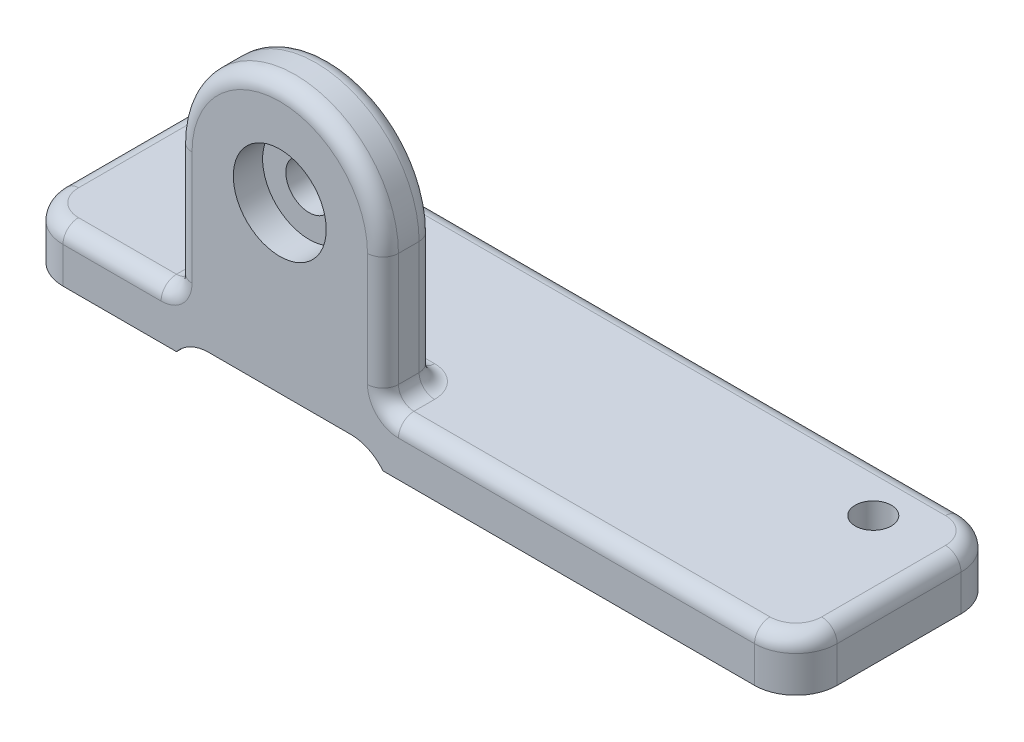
ISO-10303-21;
HEADER;
FILE_DESCRIPTION(('STEP AP214'),'2;1');
FILE_NAME('part.step','',(''),(''),'','','');
FILE_SCHEMA(('AUTOMOTIVE_DESIGN { 1 0 10303 214 1 1 1 1 }'));
ENDSEC;
DATA;
#1=APPLICATION_CONTEXT('core data for automotive mechanical design processes');
#2=APPLICATION_PROTOCOL_DEFINITION('international standard','automotive_design',2000,#1);
#3=PRODUCT_CONTEXT('',#1,'mechanical');
#4=PRODUCT('Part','Part','',(#3));
#5=PRODUCT_RELATED_PRODUCT_CATEGORY('part','',(#4));
#6=PRODUCT_DEFINITION_FORMATION('','',#4);
#7=PRODUCT_DEFINITION_CONTEXT('part definition',#1,'design');
#8=PRODUCT_DEFINITION('design','',#6,#7);
#9=PRODUCT_DEFINITION_SHAPE('','',#8);
#10=(LENGTH_UNIT() NAMED_UNIT(*) SI_UNIT(.MILLI.,.METRE.));
#11=(NAMED_UNIT(*) PLANE_ANGLE_UNIT() SI_UNIT($,.RADIAN.));
#12=(NAMED_UNIT(*) SI_UNIT($,.STERADIAN.) SOLID_ANGLE_UNIT());
#13=UNCERTAINTY_MEASURE_WITH_UNIT(LENGTH_MEASURE(1.E-05),#10,'distance_accuracy_value','');
#14=(GEOMETRIC_REPRESENTATION_CONTEXT(3) GLOBAL_UNCERTAINTY_ASSIGNED_CONTEXT((#13)) GLOBAL_UNIT_ASSIGNED_CONTEXT((#10,
#11,#12)) REPRESENTATION_CONTEXT('',''));
#15=CARTESIAN_POINT('',(0.,0.,0.));
#16=DIRECTION('',(0.,0.,1.));
#17=DIRECTION('',(1.,0.,0.));
#18=AXIS2_PLACEMENT_3D('',#15,#16,#17);
#19=CARTESIAN_POINT('',(0.,0.,-40.));
#20=DIRECTION('',(0.,-1.,0.));
#21=DIRECTION('',(0.,0.,-1.));
#22=AXIS2_PLACEMENT_3D('',#19,#20,#21);
#23=PLANE('',#22);
#24=CARTESIAN_POINT('',(15.,0.,-30.));
#25=DIRECTION('',(0.,1.,0.));
#26=DIRECTION('',(0.,0.,1.));
#27=AXIS2_PLACEMENT_3D('',#24,#25,#26);
#28=CIRCLE('',#27,3.5);
#29=CARTESIAN_POINT('',(15.,0.,-26.5));
#30=VERTEX_POINT('',#29);
#31=EDGE_CURVE('E600',#30,#30,#28,.T.);
#32=ORIENTED_EDGE('',*,*,#31,.T.);
#33=EDGE_LOOP('',(#32));
#34=FACE_BOUND('',#33,.T.);
#35=DIRECTION('',(1.,0.,0.));
#36=VECTOR('',#35,1.);
#37=CARTESIAN_POINT('',(0.,0.,0.));
#38=LINE('',#37,#36);
#39=CARTESIAN_POINT('',(8.,0.,0.));
#40=VERTEX_POINT('',#39);
#41=CARTESIAN_POINT('',(30.,0.,0.));
#42=VERTEX_POINT('',#41);
#43=EDGE_CURVE('E288',#40,#42,#38,.T.);
#44=ORIENTED_EDGE('',*,*,#43,.F.);
#45=CARTESIAN_POINT('',(8.,0.,-8.));
#46=DIRECTION('',(0.,-1.,0.));
#47=DIRECTION('',(0.,0.,-1.));
#48=AXIS2_PLACEMENT_3D('',#45,#46,#47);
#49=CIRCLE('',#48,8.);
#50=CARTESIAN_POINT('',(0.,0.,-8.));
#51=VERTEX_POINT('',#50);
#52=EDGE_CURVE('E314',#40,#51,#49,.T.);
#53=ORIENTED_EDGE('',*,*,#52,.T.);
#54=DIRECTION('',(0.,0.,1.));
#55=VECTOR('',#54,1.);
#56=CARTESIAN_POINT('',(0.,0.,0.));
#57=LINE('',#56,#55);
#58=CARTESIAN_POINT('',(0.,0.,-32.));
#59=VERTEX_POINT('',#58);
#60=EDGE_CURVE('E278',#59,#51,#57,.T.);
#61=ORIENTED_EDGE('',*,*,#60,.F.);
#62=CARTESIAN_POINT('',(8.,0.,-32.));
#63=DIRECTION('',(0.,-1.,0.));
#64=DIRECTION('',(0.,0.,-1.));
#65=AXIS2_PLACEMENT_3D('',#62,#63,#64);
#66=CIRCLE('',#65,8.);
#67=CARTESIAN_POINT('',(8.,0.,-40.));
#68=VERTEX_POINT('',#67);
#69=EDGE_CURVE('E253',#59,#68,#66,.T.);
#70=ORIENTED_EDGE('',*,*,#69,.T.);
#71=DIRECTION('',(-1.,0.,0.));
#72=VECTOR('',#71,1.);
#73=CARTESIAN_POINT('',(0.,0.,-40.));
#74=LINE('',#73,#72);
#75=CARTESIAN_POINT('',(30.,0.,-40.));
#76=VERTEX_POINT('',#75);
#77=EDGE_CURVE('E238',#76,#68,#74,.T.);
#78=ORIENTED_EDGE('',*,*,#77,.F.);
#79=DIRECTION('',(0.,0.,1.));
#80=VECTOR('',#79,1.);
#81=CARTESIAN_POINT('',(30.,0.,-40.));
#82=LINE('',#81,#80);
#83=EDGE_CURVE('E255',#76,#42,#82,.T.);
#84=ORIENTED_EDGE('',*,*,#83,.T.);
#85=EDGE_LOOP('',(#44,#53,#61,#70,#78,#84));
#86=FACE_BOUND('',#85,.T.);
#87=ADVANCED_FACE('F50',(#34,#86),#23,.T.);
#88=CARTESIAN_POINT('',(0.,10.,0.));
#89=DIRECTION('',(1.,0.,0.));
#90=DIRECTION('',(0.,0.,-1.));
#91=AXIS2_PLACEMENT_3D('',#88,#89,#90);
#92=PLANE('',#91);
#93=DIRECTION('',(0.,-1.,0.));
#94=VECTOR('',#93,1.);
#95=CARTESIAN_POINT('',(0.,10.,-8.));
#96=LINE('',#95,#94);
#97=CARTESIAN_POINT('',(0.,7.,-8.));
#98=VERTEX_POINT('',#97);
#99=EDGE_CURVE('E321',#51,#98,#96,.F.);
#100=ORIENTED_EDGE('',*,*,#99,.T.);
#101=DIRECTION('',(0.,0.,1.));
#102=VECTOR('',#101,1.);
#103=CARTESIAN_POINT('',(0.,7.,0.));
#104=LINE('',#103,#102);
#105=CARTESIAN_POINT('',(0.,7.,-32.));
#106=VERTEX_POINT('',#105);
#107=EDGE_CURVE('E396',#98,#106,#104,.F.);
#108=ORIENTED_EDGE('',*,*,#107,.T.);
#109=DIRECTION('',(0.,-1.,0.));
#110=VECTOR('',#109,1.);
#111=CARTESIAN_POINT('',(0.,10.,-32.));
#112=LINE('',#111,#110);
#113=EDGE_CURVE('E319',#106,#59,#112,.T.);
#114=ORIENTED_EDGE('',*,*,#113,.T.);
#115=ORIENTED_EDGE('',*,*,#60,.T.);
#116=EDGE_LOOP('',(#100,#108,#114,#115));
#117=FACE_BOUND('',#116,.T.);
#118=ADVANCED_FACE('F618',(#117),#92,.F.);
#119=CARTESIAN_POINT('',(0.,10.,0.));
#120=DIRECTION('',(0.,0.,-1.));
#121=DIRECTION('',(-1.,0.,0.));
#122=AXIS2_PLACEMENT_3D('',#119,#120,#121);
#123=PLANE('',#122);
#124=CARTESIAN_POINT('',(50.,35.,0.));
#125=DIRECTION('',(0.,0.,1.));
#126=DIRECTION('',(1.,0.,0.));
#127=AXIS2_PLACEMENT_3D('',#124,#125,#126);
#128=CIRCLE('',#127,9.005);
#129=CARTESIAN_POINT('',(59.005,35.,0.));
#130=VERTEX_POINT('',#129);
#131=EDGE_CURVE('E299',#130,#130,#128,.T.);
#132=ORIENTED_EDGE('',*,*,#131,.F.);
#133=EDGE_LOOP('',(#132));
#134=FACE_BOUND('',#133,.T.);
#135=CARTESIAN_POINT('',(27.,13.,0.));
#136=DIRECTION('',(0.,0.,-1.));
#137=DIRECTION('',(-1.,0.,0.));
#138=AXIS2_PLACEMENT_3D('',#135,#136,#137);
#139=CIRCLE('',#138,6.);
#140=CARTESIAN_POINT('',(27.,7.,0.));
#141=VERTEX_POINT('',#140);
#142=CARTESIAN_POINT('',(33.,13.,0.));
#143=VERTEX_POINT('',#142);
#144=EDGE_CURVE('E426',#141,#143,#139,.F.);
#145=ORIENTED_EDGE('',*,*,#144,.F.);
#146=DIRECTION('',(1.,0.,0.));
#147=VECTOR('',#146,1.);
#148=CARTESIAN_POINT('',(0.,7.,0.));
#149=LINE('',#148,#147);
#150=CARTESIAN_POINT('',(8.,7.,0.));
#151=VERTEX_POINT('',#150);
#152=EDGE_CURVE('E435',#141,#151,#149,.F.);
#153=ORIENTED_EDGE('',*,*,#152,.T.);
#154=DIRECTION('',(0.,-1.,0.));
#155=VECTOR('',#154,1.);
#156=CARTESIAN_POINT('',(8.,10.,0.));
#157=LINE('',#156,#155);
#158=EDGE_CURVE('E309',#151,#40,#157,.T.);
#159=ORIENTED_EDGE('',*,*,#158,.T.);
#160=ORIENTED_EDGE('',*,*,#43,.T.);
#161=CARTESIAN_POINT('',(36.2449979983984,-5.,0.));
#162=DIRECTION('',(0.,0.,-1.));
#163=DIRECTION('',(-1.,0.,0.));
#164=AXIS2_PLACEMENT_3D('',#161,#162,#163);
#165=CIRCLE('',#164,8.);
#166=CARTESIAN_POINT('',(36.2449979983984,3.,0.));
#167=VERTEX_POINT('',#166);
#168=EDGE_CURVE('E250',#42,#167,#165,.T.);
#169=ORIENTED_EDGE('',*,*,#168,.T.);
#170=DIRECTION('',(-1.,0.,0.));
#171=VECTOR('',#170,1.);
#172=CARTESIAN_POINT('',(30.,3.,0.));
#173=LINE('',#172,#171);
#174=CARTESIAN_POINT('',(63.7550020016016,3.,0.));
#175=VERTEX_POINT('',#174);
#176=EDGE_CURVE('E272',#175,#167,#173,.T.);
#177=ORIENTED_EDGE('',*,*,#176,.F.);
#178=CARTESIAN_POINT('',(63.7550020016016,-5.,0.));
#179=DIRECTION('',(0.,0.,-1.));
#180=DIRECTION('',(-1.,0.,0.));
#181=AXIS2_PLACEMENT_3D('',#178,#179,#180);
#182=CIRCLE('',#181,8.);
#183=CARTESIAN_POINT('',(70.,0.,0.));
#184=VERTEX_POINT('',#183);
#185=EDGE_CURVE('E343',#175,#184,#182,.T.);
#186=ORIENTED_EDGE('',*,*,#185,.T.);
#187=CARTESIAN_POINT('',(142.,0.,0.));
#188=VERTEX_POINT('',#187);
#189=EDGE_CURVE('E283',#184,#188,#38,.T.);
#190=ORIENTED_EDGE('',*,*,#189,.T.);
#191=DIRECTION('',(0.,-1.,0.));
#192=VECTOR('',#191,1.);
#193=CARTESIAN_POINT('',(142.,10.,0.));
#194=LINE('',#193,#192);
#195=CARTESIAN_POINT('',(142.,7.,0.));
#196=VERTEX_POINT('',#195);
#197=EDGE_CURVE('E306',#188,#196,#194,.F.);
#198=ORIENTED_EDGE('',*,*,#197,.T.);
#199=DIRECTION('',(1.,0.,0.));
#200=VECTOR('',#199,1.);
#201=CARTESIAN_POINT('',(0.,7.,0.));
#202=LINE('',#201,#200);
#203=CARTESIAN_POINT('',(73.,7.,0.));
#204=VERTEX_POINT('',#203);
#205=EDGE_CURVE('E424',#196,#204,#202,.F.);
#206=ORIENTED_EDGE('',*,*,#205,.T.);
#207=CARTESIAN_POINT('',(73.,13.,0.));
#208=DIRECTION('',(0.,0.,-1.));
#209=DIRECTION('',(-1.,0.,0.));
#210=AXIS2_PLACEMENT_3D('',#207,#208,#209);
#211=CIRCLE('',#210,6.);
#212=CARTESIAN_POINT('',(67.,13.,0.));
#213=VERTEX_POINT('',#212);
#214=EDGE_CURVE('E423',#213,#204,#211,.F.);
#215=ORIENTED_EDGE('',*,*,#214,.F.);
#216=DIRECTION('',(0.,1.,0.));
#217=VECTOR('',#216,1.);
#218=CARTESIAN_POINT('',(67.,35.,0.));
#219=LINE('',#218,#217);
#220=CARTESIAN_POINT('',(67.,35.,0.));
#221=VERTEX_POINT('',#220);
#222=EDGE_CURVE('E417',#213,#221,#219,.T.);
#223=ORIENTED_EDGE('',*,*,#222,.T.);
#224=CARTESIAN_POINT('',(50.,35.,0.));
#225=DIRECTION('',(0.,0.,-1.));
#226=DIRECTION('',(-1.,0.,0.));
#227=AXIS2_PLACEMENT_3D('',#224,#225,#226);
#228=CIRCLE('',#227,17.);
#229=CARTESIAN_POINT('',(33.,35.,0.));
#230=VERTEX_POINT('',#229);
#231=EDGE_CURVE('E414',#221,#230,#228,.F.);
#232=ORIENTED_EDGE('',*,*,#231,.T.);
#233=DIRECTION('',(0.,-1.,0.));
#234=VECTOR('',#233,1.);
#235=CARTESIAN_POINT('',(33.,10.,0.));
#236=LINE('',#235,#234);
#237=EDGE_CURVE('E413',#230,#143,#236,.T.);
#238=ORIENTED_EDGE('',*,*,#237,.T.);
#239=EDGE_LOOP('',(#145,#153,#159,#160,#169,#177,#186,#190,#198,#206,#215,#223,#232,#238));
#240=FACE_BOUND('',#239,.T.);
#241=ADVANCED_FACE('F610',(#134,#240),#123,.F.);
#242=CARTESIAN_POINT('',(150.,10.,0.));
#243=DIRECTION('',(-1.,0.,0.));
#244=DIRECTION('',(0.,0.,1.));
#245=AXIS2_PLACEMENT_3D('',#242,#243,#244);
#246=PLANE('',#245);
#247=DIRECTION('',(0.,-1.,0.));
#248=VECTOR('',#247,1.);
#249=CARTESIAN_POINT('',(150.,10.,-32.));
#250=LINE('',#249,#248);
#251=CARTESIAN_POINT('',(150.,0.,-32.));
#252=VERTEX_POINT('',#251);
#253=CARTESIAN_POINT('',(150.,7.,-32.));
#254=VERTEX_POINT('',#253);
#255=EDGE_CURVE('E338',#252,#254,#250,.F.);
#256=ORIENTED_EDGE('',*,*,#255,.T.);
#257=DIRECTION('',(0.,0.,-1.));
#258=VECTOR('',#257,1.);
#259=CARTESIAN_POINT('',(150.,7.,0.));
#260=LINE('',#259,#258);
#261=CARTESIAN_POINT('',(150.,7.,-8.));
#262=VERTEX_POINT('',#261);
#263=EDGE_CURVE('E434',#254,#262,#260,.F.);
#264=ORIENTED_EDGE('',*,*,#263,.T.);
#265=DIRECTION('',(0.,-1.,0.));
#266=VECTOR('',#265,1.);
#267=CARTESIAN_POINT('',(150.,10.,-8.));
#268=LINE('',#267,#266);
#269=CARTESIAN_POINT('',(150.,0.,-8.));
#270=VERTEX_POINT('',#269);
#271=EDGE_CURVE('E340',#262,#270,#268,.T.);
#272=ORIENTED_EDGE('',*,*,#271,.T.);
#273=DIRECTION('',(0.,0.,-1.));
#274=VECTOR('',#273,1.);
#275=CARTESIAN_POINT('',(150.,0.,0.));
#276=LINE('',#275,#274);
#277=EDGE_CURVE('E257',#270,#252,#276,.T.);
#278=ORIENTED_EDGE('',*,*,#277,.T.);
#279=EDGE_LOOP('',(#256,#264,#272,#278));
#280=FACE_BOUND('',#279,.T.);
#281=ADVANCED_FACE('F656',(#280),#246,.F.);
#282=CARTESIAN_POINT('',(0.,10.,-40.));
#283=DIRECTION('',(0.,0.,1.));
#284=DIRECTION('',(1.,0.,0.));
#285=AXIS2_PLACEMENT_3D('',#282,#283,#284);
#286=PLANE('',#285);
#287=DIRECTION('',(0.,-1.,0.));
#288=VECTOR('',#287,1.);
#289=CARTESIAN_POINT('',(8.,10.,-40.));
#290=LINE('',#289,#288);
#291=CARTESIAN_POINT('',(8.,7.,-40.));
#292=VERTEX_POINT('',#291);
#293=EDGE_CURVE('E330',#68,#292,#290,.F.);
#294=ORIENTED_EDGE('',*,*,#293,.T.);
#295=DIRECTION('',(-1.,0.,0.));
#296=VECTOR('',#295,1.);
#297=CARTESIAN_POINT('',(0.,7.,-40.));
#298=LINE('',#297,#296);
#299=CARTESIAN_POINT('',(142.,7.,-40.));
#300=VERTEX_POINT('',#299);
#301=EDGE_CURVE('E401',#292,#300,#298,.F.);
#302=ORIENTED_EDGE('',*,*,#301,.T.);
#303=DIRECTION('',(0.,-1.,0.));
#304=VECTOR('',#303,1.);
#305=CARTESIAN_POINT('',(142.,10.,-40.));
#306=LINE('',#305,#304);
#307=CARTESIAN_POINT('',(142.,0.,-40.));
#308=VERTEX_POINT('',#307);
#309=EDGE_CURVE('E324',#300,#308,#306,.T.);
#310=ORIENTED_EDGE('',*,*,#309,.T.);
#311=CARTESIAN_POINT('',(70.,0.,-40.));
#312=VERTEX_POINT('',#311);
#313=EDGE_CURVE('E260',#308,#312,#74,.T.);
#314=ORIENTED_EDGE('',*,*,#313,.T.);
#315=CARTESIAN_POINT('',(63.7550020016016,-5.,-40.));
#316=DIRECTION('',(0.,0.,1.));
#317=DIRECTION('',(1.,0.,0.));
#318=AXIS2_PLACEMENT_3D('',#315,#316,#317);
#319=CIRCLE('',#318,8.);
#320=CARTESIAN_POINT('',(63.7550020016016,3.,-40.));
#321=VERTEX_POINT('',#320);
#322=EDGE_CURVE('E349',#312,#321,#319,.T.);
#323=ORIENTED_EDGE('',*,*,#322,.T.);
#324=DIRECTION('',(-1.,0.,0.));
#325=VECTOR('',#324,1.);
#326=CARTESIAN_POINT('',(30.,3.,-40.));
#327=LINE('',#326,#325);
#328=CARTESIAN_POINT('',(36.2449979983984,3.,-40.));
#329=VERTEX_POINT('',#328);
#330=EDGE_CURVE('E241',#321,#329,#327,.T.);
#331=ORIENTED_EDGE('',*,*,#330,.T.);
#332=CARTESIAN_POINT('',(36.2449979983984,-5.,-40.));
#333=DIRECTION('',(0.,0.,1.));
#334=DIRECTION('',(1.,0.,0.));
#335=AXIS2_PLACEMENT_3D('',#332,#333,#334);
#336=CIRCLE('',#335,8.);
#337=EDGE_CURVE('E234',#329,#76,#336,.T.);
#338=ORIENTED_EDGE('',*,*,#337,.T.);
#339=ORIENTED_EDGE('',*,*,#77,.T.);
#340=EDGE_LOOP('',(#294,#302,#310,#314,#323,#331,#338,#339));
#341=FACE_BOUND('',#340,.T.);
#342=ADVANCED_FACE('F240',(#341),#286,.F.);
#343=CARTESIAN_POINT('',(0.,10.,-40.));
#344=DIRECTION('',(0.,-1.,0.));
#345=DIRECTION('',(0.,0.,-1.));
#346=AXIS2_PLACEMENT_3D('',#343,#344,#345);
#347=PLANE('',#346);
#348=DIRECTION('',(-1.,0.,0.));
#349=VECTOR('',#348,1.);
#350=CARTESIAN_POINT('',(0.,10.,-37.));
#351=LINE('',#350,#349);
#352=CARTESIAN_POINT('',(142.,10.,-37.));
#353=VERTEX_POINT('',#352);
#354=CARTESIAN_POINT('',(8.,10.,-37.));
#355=VERTEX_POINT('',#354);
#356=EDGE_CURVE('E386',#353,#355,#351,.T.);
#357=ORIENTED_EDGE('',*,*,#356,.T.);
#358=CARTESIAN_POINT('',(8.,10.,-32.));
#359=DIRECTION('',(0.,-1.,0.));
#360=DIRECTION('',(0.,0.,-1.));
#361=AXIS2_PLACEMENT_3D('',#358,#359,#360);
#362=CIRCLE('',#361,5.);
#363=CARTESIAN_POINT('',(3.,10.,-32.));
#364=VERTEX_POINT('',#363);
#365=EDGE_CURVE('E394',#355,#364,#362,.F.);
#366=ORIENTED_EDGE('',*,*,#365,.T.);
#367=DIRECTION('',(0.,0.,1.));
#368=VECTOR('',#367,1.);
#369=CARTESIAN_POINT('',(3.,10.,-40.));
#370=LINE('',#369,#368);
#371=CARTESIAN_POINT('',(3.,10.,-8.));
#372=VERTEX_POINT('',#371);
#373=EDGE_CURVE('E388',#364,#372,#370,.T.);
#374=ORIENTED_EDGE('',*,*,#373,.T.);
#375=CARTESIAN_POINT('',(8.,10.,-8.));
#376=DIRECTION('',(0.,-1.,0.));
#377=DIRECTION('',(0.,0.,-1.));
#378=AXIS2_PLACEMENT_3D('',#375,#376,#377);
#379=CIRCLE('',#378,5.);
#380=CARTESIAN_POINT('',(8.,10.,-3.));
#381=VERTEX_POINT('',#380);
#382=EDGE_CURVE('E384',#372,#381,#379,.F.);
#383=ORIENTED_EDGE('',*,*,#382,.T.);
#384=DIRECTION('',(1.,0.,0.));
#385=VECTOR('',#384,1.);
#386=CARTESIAN_POINT('',(0.,10.,-3.));
#387=LINE('',#386,#385);
#388=CARTESIAN_POINT('',(27.,10.,-3.));
#389=VERTEX_POINT('',#388);
#390=EDGE_CURVE('E380',#381,#389,#387,.T.);
#391=ORIENTED_EDGE('',*,*,#390,.T.);
#392=DIRECTION('',(0.,0.,-1.));
#393=VECTOR('',#392,1.);
#394=CARTESIAN_POINT('',(27.,10.,-40.));
#395=LINE('',#394,#393);
#396=CARTESIAN_POINT('',(27.,10.,-7.));
#397=VERTEX_POINT('',#396);
#398=EDGE_CURVE('E371',#389,#397,#395,.T.);
#399=ORIENTED_EDGE('',*,*,#398,.T.);
#400=CARTESIAN_POINT('',(33.,10.,-7.));
#401=DIRECTION('',(0.,-1.,0.));
#402=DIRECTION('',(0.,0.,-1.));
#403=AXIS2_PLACEMENT_3D('',#400,#401,#402);
#404=CIRCLE('',#403,6.);
#405=CARTESIAN_POINT('',(33.,10.,-13.));
#406=VERTEX_POINT('',#405);
#407=EDGE_CURVE('E370',#406,#397,#404,.F.);
#408=ORIENTED_EDGE('',*,*,#407,.F.);
#409=DIRECTION('',(1.,0.,0.));
#410=VECTOR('',#409,1.);
#411=CARTESIAN_POINT('',(0.,10.,-13.));
#412=LINE('',#411,#410);
#413=CARTESIAN_POINT('',(67.,10.,-13.));
#414=VERTEX_POINT('',#413);
#415=EDGE_CURVE('E363',#406,#414,#412,.T.);
#416=ORIENTED_EDGE('',*,*,#415,.T.);
#417=CARTESIAN_POINT('',(67.,10.,-7.));
#418=DIRECTION('',(0.,-1.,0.));
#419=DIRECTION('',(0.,0.,-1.));
#420=AXIS2_PLACEMENT_3D('',#417,#418,#419);
#421=CIRCLE('',#420,6.);
#422=CARTESIAN_POINT('',(73.,10.,-7.));
#423=VERTEX_POINT('',#422);
#424=EDGE_CURVE('E357',#423,#414,#421,.F.);
#425=ORIENTED_EDGE('',*,*,#424,.F.);
#426=DIRECTION('',(0.,0.,1.));
#427=VECTOR('',#426,1.);
#428=CARTESIAN_POINT('',(73.,10.,-40.));
#429=LINE('',#428,#427);
#430=CARTESIAN_POINT('',(73.,10.,-3.));
#431=VERTEX_POINT('',#430);
#432=EDGE_CURVE('E246',#423,#431,#429,.T.);
#433=ORIENTED_EDGE('',*,*,#432,.T.);
#434=DIRECTION('',(1.,0.,0.));
#435=VECTOR('',#434,1.);
#436=CARTESIAN_POINT('',(0.,10.,-3.));
#437=LINE('',#436,#435);
#438=CARTESIAN_POINT('',(142.,10.,-3.));
#439=VERTEX_POINT('',#438);
#440=EDGE_CURVE('E355',#431,#439,#437,.T.);
#441=ORIENTED_EDGE('',*,*,#440,.T.);
#442=CARTESIAN_POINT('',(142.,10.,-8.));
#443=DIRECTION('',(0.,-1.,0.));
#444=DIRECTION('',(0.,0.,-1.));
#445=AXIS2_PLACEMENT_3D('',#442,#443,#444);
#446=CIRCLE('',#445,5.);
#447=CARTESIAN_POINT('',(147.,10.,-8.));
#448=VERTEX_POINT('',#447);
#449=EDGE_CURVE('E364',#439,#448,#446,.F.);
#450=ORIENTED_EDGE('',*,*,#449,.T.);
#451=DIRECTION('',(0.,0.,-1.));
#452=VECTOR('',#451,1.);
#453=CARTESIAN_POINT('',(147.,10.,-40.));
#454=LINE('',#453,#452);
#455=CARTESIAN_POINT('',(147.,10.,-32.));
#456=VERTEX_POINT('',#455);
#457=EDGE_CURVE('E372',#448,#456,#454,.T.);
#458=ORIENTED_EDGE('',*,*,#457,.T.);
#459=CARTESIAN_POINT('',(142.,10.,-32.));
#460=DIRECTION('',(0.,-1.,0.));
#461=DIRECTION('',(0.,0.,-1.));
#462=AXIS2_PLACEMENT_3D('',#459,#460,#461);
#463=CIRCLE('',#462,5.);
#464=EDGE_CURVE('E379',#456,#353,#463,.F.);
#465=ORIENTED_EDGE('',*,*,#464,.T.);
#466=EDGE_LOOP('',(#357,#366,#374,#383,#391,#399,#408,#416,#425,#433,#441,#450,#458,#465));
#467=FACE_BOUND('',#466,.T.);
#468=CARTESIAN_POINT('',(135.,10.,-30.));
#469=DIRECTION('',(0.,1.,0.));
#470=DIRECTION('',(0.,0.,1.));
#471=AXIS2_PLACEMENT_3D('',#468,#469,#470);
#472=CIRCLE('',#471,3.49999999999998);
#473=CARTESIAN_POINT('',(135.,10.,-26.5));
#474=VERTEX_POINT('',#473);
#475=EDGE_CURVE('E296',#474,#474,#472,.T.);
#476=ORIENTED_EDGE('',*,*,#475,.F.);
#477=EDGE_LOOP('',(#476));
#478=FACE_BOUND('',#477,.T.);
#479=CARTESIAN_POINT('',(15.,10.,-30.));
#480=DIRECTION('',(0.,1.,0.));
#481=DIRECTION('',(0.,0.,1.));
#482=AXIS2_PLACEMENT_3D('',#479,#480,#481);
#483=CIRCLE('',#482,3.49999999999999);
#484=CARTESIAN_POINT('',(15.,10.,-26.5));
#485=VERTEX_POINT('',#484);
#486=EDGE_CURVE('E592',#485,#485,#483,.T.);
#487=ORIENTED_EDGE('',*,*,#486,.F.);
#488=EDGE_LOOP('',(#487));
#489=FACE_BOUND('',#488,.T.);
#490=ADVANCED_FACE('F703',(#467,#478,#489),#347,.F.);
#491=CARTESIAN_POINT('',(135.,0.,-30.));
#492=DIRECTION('',(0.,1.,0.));
#493=DIRECTION('',(0.,0.,1.));
#494=AXIS2_PLACEMENT_3D('',#491,#492,#493);
#495=CIRCLE('',#494,3.5);
#496=CARTESIAN_POINT('',(135.,0.,-26.5));
#497=VERTEX_POINT('',#496);
#498=EDGE_CURVE('E586',#497,#497,#495,.T.);
#499=ORIENTED_EDGE('',*,*,#498,.T.);
#500=EDGE_LOOP('',(#499));
#501=FACE_BOUND('',#500,.T.);
#502=ORIENTED_EDGE('',*,*,#313,.F.);
#503=CARTESIAN_POINT('',(142.,0.,-32.));
#504=DIRECTION('',(0.,-1.,0.));
#505=DIRECTION('',(0.,0.,-1.));
#506=AXIS2_PLACEMENT_3D('',#503,#504,#505);
#507=CIRCLE('',#506,8.);
#508=EDGE_CURVE('E335',#308,#252,#507,.T.);
#509=ORIENTED_EDGE('',*,*,#508,.T.);
#510=ORIENTED_EDGE('',*,*,#277,.F.);
#511=CARTESIAN_POINT('',(142.,0.,-8.));
#512=DIRECTION('',(0.,-1.,0.));
#513=DIRECTION('',(0.,0.,-1.));
#514=AXIS2_PLACEMENT_3D('',#511,#512,#513);
#515=CIRCLE('',#514,8.);
#516=EDGE_CURVE('E333',#270,#188,#515,.T.);
#517=ORIENTED_EDGE('',*,*,#516,.T.);
#518=ORIENTED_EDGE('',*,*,#189,.F.);
#519=DIRECTION('',(0.,0.,1.));
#520=VECTOR('',#519,1.);
#521=CARTESIAN_POINT('',(70.,0.,-40.));
#522=LINE('',#521,#520);
#523=EDGE_CURVE('E265',#312,#184,#522,.T.);
#524=ORIENTED_EDGE('',*,*,#523,.F.);
#525=EDGE_LOOP('',(#502,#509,#510,#517,#518,#524));
#526=FACE_BOUND('',#525,.T.);
#527=ADVANCED_FACE('F737',(#501,#526),#23,.T.);
#528=CARTESIAN_POINT('',(30.,0.,-10.));
#529=DIRECTION('',(-1.,0.,0.));
#530=DIRECTION('',(0.,-1.,0.));
#531=AXIS2_PLACEMENT_3D('',#528,#529,#530);
#532=PLANE('',#531);
#533=DIRECTION('',(0.,0.,1.));
#534=VECTOR('',#533,1.);
#535=CARTESIAN_POINT('',(30.,35.,-10.));
#536=LINE('',#535,#534);
#537=CARTESIAN_POINT('',(30.,35.,-7.));
#538=VERTEX_POINT('',#537);
#539=CARTESIAN_POINT('',(30.,35.,-3.));
#540=VERTEX_POINT('',#539);
#541=EDGE_CURVE('E273',#538,#540,#536,.T.);
#542=ORIENTED_EDGE('',*,*,#541,.F.);
#543=DIRECTION('',(0.,-1.,0.));
#544=VECTOR('',#543,1.);
#545=CARTESIAN_POINT('',(30.,0.,-7.));
#546=LINE('',#545,#544);
#547=CARTESIAN_POINT('',(30.,13.,-7.));
#548=VERTEX_POINT('',#547);
#549=EDGE_CURVE('E444',#538,#548,#546,.T.);
#550=ORIENTED_EDGE('',*,*,#549,.T.);
#551=DIRECTION('',(0.,0.,-1.));
#552=VECTOR('',#551,1.);
#553=CARTESIAN_POINT('',(30.,13.,-10.));
#554=LINE('',#553,#552);
#555=CARTESIAN_POINT('',(30.,13.,-3.));
#556=VERTEX_POINT('',#555);
#557=EDGE_CURVE('E441',#548,#556,#554,.F.);
#558=ORIENTED_EDGE('',*,*,#557,.T.);
#559=DIRECTION('',(0.,-1.,0.));
#560=VECTOR('',#559,1.);
#561=CARTESIAN_POINT('',(30.,35.,-3.));
#562=LINE('',#561,#560);
#563=EDGE_CURVE('E438',#556,#540,#562,.F.);
#564=ORIENTED_EDGE('',*,*,#563,.T.);
#565=EDGE_LOOP('',(#542,#550,#558,#564));
#566=FACE_BOUND('',#565,.T.);
#567=ADVANCED_FACE('F745',(#566),#532,.T.);
#568=CARTESIAN_POINT('',(70.,35.,-10.));
#569=DIRECTION('',(1.,0.,0.));
#570=DIRECTION('',(0.,0.,-1.));
#571=AXIS2_PLACEMENT_3D('',#568,#569,#570);
#572=PLANE('',#571);
#573=DIRECTION('',(0.,0.,1.));
#574=VECTOR('',#573,1.);
#575=CARTESIAN_POINT('',(70.,13.,-10.));
#576=LINE('',#575,#574);
#577=CARTESIAN_POINT('',(70.,13.,-3.));
#578=VERTEX_POINT('',#577);
#579=CARTESIAN_POINT('',(70.,13.,-7.));
#580=VERTEX_POINT('',#579);
#581=EDGE_CURVE('E64',#578,#580,#576,.F.);
#582=ORIENTED_EDGE('',*,*,#581,.T.);
#583=DIRECTION('',(0.,1.,0.));
#584=VECTOR('',#583,1.);
#585=CARTESIAN_POINT('',(70.,35.,-7.));
#586=LINE('',#585,#584);
#587=CARTESIAN_POINT('',(70.,35.,-7.));
#588=VERTEX_POINT('',#587);
#589=EDGE_CURVE('E466',#580,#588,#586,.T.);
#590=ORIENTED_EDGE('',*,*,#589,.T.);
#591=DIRECTION('',(0.,0.,1.));
#592=VECTOR('',#591,1.);
#593=CARTESIAN_POINT('',(70.,35.,-10.));
#594=LINE('',#593,#592);
#595=CARTESIAN_POINT('',(70.,35.,-3.));
#596=VERTEX_POINT('',#595);
#597=EDGE_CURVE('E270',#588,#596,#594,.T.);
#598=ORIENTED_EDGE('',*,*,#597,.T.);
#599=DIRECTION('',(0.,1.,0.));
#600=VECTOR('',#599,1.);
#601=CARTESIAN_POINT('',(70.,10.,-3.));
#602=LINE('',#601,#600);
#603=EDGE_CURVE('E68',#596,#578,#602,.F.);
#604=ORIENTED_EDGE('',*,*,#603,.T.);
#605=EDGE_LOOP('',(#582,#590,#598,#604));
#606=FACE_BOUND('',#605,.T.);
#607=ADVANCED_FACE('F749',(#606),#572,.T.);
#608=CARTESIAN_POINT('',(50.,35.,-10.));
#609=DIRECTION('',(0.,0.,-1.));
#610=DIRECTION('',(-1.,0.,0.));
#611=AXIS2_PLACEMENT_3D('',#608,#609,#610);
#612=PLANE('',#611);
#613=DIRECTION('',(0.,1.,0.));
#614=VECTOR('',#613,1.);
#615=CARTESIAN_POINT('',(67.,35.,-10.));
#616=LINE('',#615,#614);
#617=CARTESIAN_POINT('',(67.,35.,-10.));
#618=VERTEX_POINT('',#617);
#619=CARTESIAN_POINT('',(67.,13.,-10.));
#620=VERTEX_POINT('',#619);
#621=EDGE_CURVE('E459',#618,#620,#616,.F.);
#622=ORIENTED_EDGE('',*,*,#621,.T.);
#623=DIRECTION('',(1.,0.,0.));
#624=VECTOR('',#623,1.);
#625=CARTESIAN_POINT('',(50.,13.,-10.));
#626=LINE('',#625,#624);
#627=CARTESIAN_POINT('',(33.,13.,-10.));
#628=VERTEX_POINT('',#627);
#629=EDGE_CURVE('E458',#620,#628,#626,.F.);
#630=ORIENTED_EDGE('',*,*,#629,.T.);
#631=DIRECTION('',(0.,-1.,0.));
#632=VECTOR('',#631,1.);
#633=CARTESIAN_POINT('',(33.,35.,-10.));
#634=LINE('',#633,#632);
#635=CARTESIAN_POINT('',(33.,35.,-10.));
#636=VERTEX_POINT('',#635);
#637=EDGE_CURVE('E453',#628,#636,#634,.F.);
#638=ORIENTED_EDGE('',*,*,#637,.T.);
#639=CARTESIAN_POINT('',(50.,35.,-10.));
#640=DIRECTION('',(0.,0.,-1.));
#641=DIRECTION('',(-1.,0.,0.));
#642=AXIS2_PLACEMENT_3D('',#639,#640,#641);
#643=CIRCLE('',#642,17.);
#644=EDGE_CURVE('E451',#636,#618,#643,.T.);
#645=ORIENTED_EDGE('',*,*,#644,.T.);
#646=EDGE_LOOP('',(#622,#630,#638,#645));
#647=FACE_BOUND('',#646,.T.);
#648=CARTESIAN_POINT('',(50.,35.,-10.));
#649=DIRECTION('',(0.,0.,-1.));
#650=DIRECTION('',(-1.,0.,0.));
#651=AXIS2_PLACEMENT_3D('',#648,#649,#650);
#652=CIRCLE('',#651,4.5);
#653=CARTESIAN_POINT('',(45.5,35.,-10.));
#654=VERTEX_POINT('',#653);
#655=EDGE_CURVE('E295',#654,#654,#652,.T.);
#656=ORIENTED_EDGE('',*,*,#655,.F.);
#657=EDGE_LOOP('',(#656));
#658=FACE_BOUND('',#657,.T.);
#659=ADVANCED_FACE('F817',(#647,#658),#612,.T.);
#660=CARTESIAN_POINT('',(50.,35.,-10.));
#661=DIRECTION('',(0.,0.,1.));
#662=DIRECTION('',(1.,0.,0.));
#663=AXIS2_PLACEMENT_3D('',#660,#661,#662);
#664=CYLINDRICAL_SURFACE('',#663,20.);
#665=ORIENTED_EDGE('',*,*,#597,.F.);
#666=CARTESIAN_POINT('',(50.,35.,-7.));
#667=DIRECTION('',(0.,0.,-1.));
#668=DIRECTION('',(-1.,0.,0.));
#669=AXIS2_PLACEMENT_3D('',#666,#667,#668);
#670=CIRCLE('',#669,20.);
#671=EDGE_CURVE('E11',#588,#538,#670,.F.);
#672=ORIENTED_EDGE('',*,*,#671,.T.);
#673=ORIENTED_EDGE('',*,*,#541,.T.);
#674=CARTESIAN_POINT('',(50.,35.,-3.));
#675=DIRECTION('',(0.,0.,-1.));
#676=DIRECTION('',(-1.,0.,0.));
#677=AXIS2_PLACEMENT_3D('',#674,#675,#676);
#678=CIRCLE('',#677,20.);
#679=EDGE_CURVE('E60',#540,#596,#678,.T.);
#680=ORIENTED_EDGE('',*,*,#679,.T.);
#681=EDGE_LOOP('',(#665,#672,#673,#680));
#682=FACE_BOUND('',#681,.T.);
#683=ADVANCED_FACE('F824',(#682),#664,.T.);
#684=CARTESIAN_POINT('',(30.,3.,-40.));
#685=DIRECTION('',(0.,1.,0.));
#686=DIRECTION('',(0.,0.,1.));
#687=AXIS2_PLACEMENT_3D('',#684,#685,#686);
#688=PLANE('',#687);
#689=ORIENTED_EDGE('',*,*,#330,.F.);
#690=DIRECTION('',(0.,0.,-1.));
#691=VECTOR('',#690,1.);
#692=CARTESIAN_POINT('',(63.7550020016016,3.,-40.));
#693=LINE('',#692,#691);
#694=EDGE_CURVE('E305',#321,#175,#693,.F.);
#695=ORIENTED_EDGE('',*,*,#694,.T.);
#696=ORIENTED_EDGE('',*,*,#176,.T.);
#697=DIRECTION('',(0.,0.,1.));
#698=VECTOR('',#697,1.);
#699=CARTESIAN_POINT('',(36.2449979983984,3.,-40.));
#700=LINE('',#699,#698);
#701=EDGE_CURVE('E291',#167,#329,#700,.F.);
#702=ORIENTED_EDGE('',*,*,#701,.T.);
#703=EDGE_LOOP('',(#689,#695,#696,#702));
#704=FACE_BOUND('',#703,.T.);
#705=ADVANCED_FACE('F604',(#704),#688,.F.);
#706=CARTESIAN_POINT('',(15.,10.,-30.));
#707=DIRECTION('',(0.,1.,0.));
#708=DIRECTION('',(0.,0.,1.));
#709=AXIS2_PLACEMENT_3D('',#706,#707,#708);
#710=CYLINDRICAL_SURFACE('',#709,3.49999999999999);
#711=ORIENTED_EDGE('',*,*,#31,.F.);
#712=EDGE_LOOP('',(#711));
#713=FACE_BOUND('',#712,.T.);
#714=ORIENTED_EDGE('',*,*,#486,.T.);
#715=EDGE_LOOP('',(#714));
#716=FACE_BOUND('',#715,.T.);
#717=ADVANCED_FACE('F832',(#713,#716),#710,.F.);
#718=CARTESIAN_POINT('',(135.,10.,-30.));
#719=DIRECTION('',(0.,1.,0.));
#720=DIRECTION('',(0.,0.,1.));
#721=AXIS2_PLACEMENT_3D('',#718,#719,#720);
#722=CYLINDRICAL_SURFACE('',#721,3.49999999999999);
#723=ORIENTED_EDGE('',*,*,#498,.F.);
#724=EDGE_LOOP('',(#723));
#725=FACE_BOUND('',#724,.T.);
#726=ORIENTED_EDGE('',*,*,#475,.T.);
#727=EDGE_LOOP('',(#726));
#728=FACE_BOUND('',#727,.T.);
#729=ADVANCED_FACE('F1095',(#725,#728),#722,.F.);
#730=CARTESIAN_POINT('',(50.,35.,0.));
#731=DIRECTION('',(0.,0.,1.));
#732=DIRECTION('',(1.,0.,0.));
#733=AXIS2_PLACEMENT_3D('',#730,#731,#732);
#734=CYLINDRICAL_SURFACE('',#733,9.005);
#735=CARTESIAN_POINT('',(50.,35.,-5.68));
#736=DIRECTION('',(0.,0.,1.));
#737=DIRECTION('',(1.,0.,0.));
#738=AXIS2_PLACEMENT_3D('',#735,#736,#737);
#739=CIRCLE('',#738,9.005);
#740=CARTESIAN_POINT('',(59.005,35.,-5.68));
#741=VERTEX_POINT('',#740);
#742=EDGE_CURVE('E573',#741,#741,#739,.T.);
#743=ORIENTED_EDGE('',*,*,#742,.F.);
#744=EDGE_LOOP('',(#743));
#745=FACE_BOUND('',#744,.T.);
#746=ORIENTED_EDGE('',*,*,#131,.T.);
#747=EDGE_LOOP('',(#746));
#748=FACE_BOUND('',#747,.T.);
#749=ADVANCED_FACE('F1096',(#745,#748),#734,.F.);
#750=CARTESIAN_POINT('',(54.5,35.,-5.68));
#751=DIRECTION('',(0.,0.,-1.));
#752=DIRECTION('',(-1.,0.,0.));
#753=AXIS2_PLACEMENT_3D('',#750,#751,#752);
#754=PLANE('',#753);
#755=CARTESIAN_POINT('',(50.,35.,-5.68));
#756=DIRECTION('',(0.,0.,1.));
#757=DIRECTION('',(1.,0.,0.));
#758=AXIS2_PLACEMENT_3D('',#755,#756,#757);
#759=CIRCLE('',#758,4.5);
#760=CARTESIAN_POINT('',(54.5,35.,-5.68));
#761=VERTEX_POINT('',#760);
#762=EDGE_CURVE('E566',#761,#761,#759,.T.);
#763=ORIENTED_EDGE('',*,*,#762,.F.);
#764=EDGE_LOOP('',(#763));
#765=FACE_BOUND('',#764,.T.);
#766=ORIENTED_EDGE('',*,*,#742,.T.);
#767=EDGE_LOOP('',(#766));
#768=FACE_BOUND('',#767,.T.);
#769=ADVANCED_FACE('F770',(#765,#768),#754,.F.);
#770=CARTESIAN_POINT('',(50.,35.,0.));
#771=DIRECTION('',(0.,0.,1.));
#772=DIRECTION('',(1.,0.,0.));
#773=AXIS2_PLACEMENT_3D('',#770,#771,#772);
#774=CYLINDRICAL_SURFACE('',#773,4.5);
#775=ORIENTED_EDGE('',*,*,#655,.T.);
#776=EDGE_LOOP('',(#775));
#777=FACE_BOUND('',#776,.T.);
#778=ORIENTED_EDGE('',*,*,#762,.T.);
#779=EDGE_LOOP('',(#778));
#780=FACE_BOUND('',#779,.T.);
#781=ADVANCED_FACE('F759',(#777,#780),#774,.F.);
#782=CARTESIAN_POINT('',(63.7550020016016,-5.,-40.));
#783=DIRECTION('',(0.,0.,-1.));
#784=DIRECTION('',(-1.,0.,0.));
#785=AXIS2_PLACEMENT_3D('',#782,#783,#784);
#786=CYLINDRICAL_SURFACE('',#785,8.);
#787=ORIENTED_EDGE('',*,*,#322,.F.);
#788=ORIENTED_EDGE('',*,*,#523,.T.);
#789=ORIENTED_EDGE('',*,*,#185,.F.);
#790=ORIENTED_EDGE('',*,*,#694,.F.);
#791=EDGE_LOOP('',(#787,#788,#789,#790));
#792=FACE_BOUND('',#791,.T.);
#793=ADVANCED_FACE('F758',(#792),#786,.F.);
#794=CARTESIAN_POINT('',(36.2449979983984,-5.,-40.));
#795=DIRECTION('',(0.,0.,1.));
#796=DIRECTION('',(1.,0.,0.));
#797=AXIS2_PLACEMENT_3D('',#794,#795,#796);
#798=CYLINDRICAL_SURFACE('',#797,8.);
#799=ORIENTED_EDGE('',*,*,#337,.F.);
#800=ORIENTED_EDGE('',*,*,#701,.F.);
#801=ORIENTED_EDGE('',*,*,#168,.F.);
#802=ORIENTED_EDGE('',*,*,#83,.F.);
#803=EDGE_LOOP('',(#799,#800,#801,#802));
#804=FACE_BOUND('',#803,.T.);
#805=ADVANCED_FACE('F259',(#804),#798,.F.);
#806=CARTESIAN_POINT('',(8.,10.,-8.));
#807=DIRECTION('',(0.,-1.,0.));
#808=DIRECTION('',(0.,0.,-1.));
#809=AXIS2_PLACEMENT_3D('',#806,#807,#808);
#810=CYLINDRICAL_SURFACE('',#809,8.);
#811=ORIENTED_EDGE('',*,*,#158,.F.);
#812=CARTESIAN_POINT('',(8.,7.,-8.));
#813=DIRECTION('',(0.,-1.,0.));
#814=DIRECTION('',(0.,0.,-1.));
#815=AXIS2_PLACEMENT_3D('',#812,#813,#814);
#816=CIRCLE('',#815,8.);
#817=EDGE_CURVE('E406',#151,#98,#816,.T.);
#818=ORIENTED_EDGE('',*,*,#817,.T.);
#819=ORIENTED_EDGE('',*,*,#99,.F.);
#820=ORIENTED_EDGE('',*,*,#52,.F.);
#821=EDGE_LOOP('',(#811,#818,#819,#820));
#822=FACE_BOUND('',#821,.T.);
#823=ADVANCED_FACE('F620',(#822),#810,.T.);
#824=CARTESIAN_POINT('',(8.,10.,-32.));
#825=DIRECTION('',(0.,-1.,0.));
#826=DIRECTION('',(0.,0.,-1.));
#827=AXIS2_PLACEMENT_3D('',#824,#825,#826);
#828=CYLINDRICAL_SURFACE('',#827,8.);
#829=ORIENTED_EDGE('',*,*,#113,.F.);
#830=CARTESIAN_POINT('',(8.,7.,-32.));
#831=DIRECTION('',(0.,-1.,0.));
#832=DIRECTION('',(0.,0.,-1.));
#833=AXIS2_PLACEMENT_3D('',#830,#831,#832);
#834=CIRCLE('',#833,8.);
#835=EDGE_CURVE('E398',#106,#292,#834,.T.);
#836=ORIENTED_EDGE('',*,*,#835,.T.);
#837=ORIENTED_EDGE('',*,*,#293,.F.);
#838=ORIENTED_EDGE('',*,*,#69,.F.);
#839=EDGE_LOOP('',(#829,#836,#837,#838));
#840=FACE_BOUND('',#839,.T.);
#841=ADVANCED_FACE('F635',(#840),#828,.T.);
#842=CARTESIAN_POINT('',(142.,10.,-32.));
#843=DIRECTION('',(0.,-1.,0.));
#844=DIRECTION('',(0.,0.,-1.));
#845=AXIS2_PLACEMENT_3D('',#842,#843,#844);
#846=CYLINDRICAL_SURFACE('',#845,8.);
#847=ORIENTED_EDGE('',*,*,#309,.F.);
#848=CARTESIAN_POINT('',(142.,7.,-32.));
#849=DIRECTION('',(0.,-1.,0.));
#850=DIRECTION('',(0.,0.,-1.));
#851=AXIS2_PLACEMENT_3D('',#848,#849,#850);
#852=CIRCLE('',#851,8.);
#853=EDGE_CURVE('E408',#300,#254,#852,.T.);
#854=ORIENTED_EDGE('',*,*,#853,.T.);
#855=ORIENTED_EDGE('',*,*,#255,.F.);
#856=ORIENTED_EDGE('',*,*,#508,.F.);
#857=EDGE_LOOP('',(#847,#854,#855,#856));
#858=FACE_BOUND('',#857,.T.);
#859=ADVANCED_FACE('F646',(#858),#846,.T.);
#860=CARTESIAN_POINT('',(142.,10.,-8.));
#861=DIRECTION('',(0.,-1.,0.));
#862=DIRECTION('',(0.,0.,-1.));
#863=AXIS2_PLACEMENT_3D('',#860,#861,#862);
#864=CYLINDRICAL_SURFACE('',#863,8.);
#865=ORIENTED_EDGE('',*,*,#271,.F.);
#866=CARTESIAN_POINT('',(142.,7.,-8.));
#867=DIRECTION('',(0.,-1.,0.));
#868=DIRECTION('',(0.,0.,-1.));
#869=AXIS2_PLACEMENT_3D('',#866,#867,#868);
#870=CIRCLE('',#869,8.);
#871=EDGE_CURVE('E449',#262,#196,#870,.T.);
#872=ORIENTED_EDGE('',*,*,#871,.T.);
#873=ORIENTED_EDGE('',*,*,#197,.F.);
#874=ORIENTED_EDGE('',*,*,#516,.F.);
#875=EDGE_LOOP('',(#865,#872,#873,#874));
#876=FACE_BOUND('',#875,.T.);
#877=ADVANCED_FACE('F664',(#876),#864,.T.);
#878=CARTESIAN_POINT('',(67.,35.,-7.));
#879=DIRECTION('',(0.,1.,0.));
#880=DIRECTION('',(0.,0.,1.));
#881=AXIS2_PLACEMENT_3D('',#878,#879,#880);
#882=CYLINDRICAL_SURFACE('',#881,3.);
#883=CARTESIAN_POINT('',(67.,13.,-7.));
#884=DIRECTION('',(0.,-1.,0.));
#885=DIRECTION('',(0.,0.,-1.));
#886=AXIS2_PLACEMENT_3D('',#883,#884,#885);
#887=CIRCLE('',#886,3.);
#888=EDGE_CURVE('E51',#620,#580,#887,.T.);
#889=ORIENTED_EDGE('',*,*,#888,.F.);
#890=ORIENTED_EDGE('',*,*,#621,.F.);
#891=CARTESIAN_POINT('',(67.,35.,-7.));
#892=DIRECTION('',(0.,1.,0.));
#893=DIRECTION('',(0.,0.,1.));
#894=AXIS2_PLACEMENT_3D('',#891,#892,#893);
#895=CIRCLE('',#894,3.);
#896=EDGE_CURVE('E558',#588,#618,#895,.T.);
#897=ORIENTED_EDGE('',*,*,#896,.F.);
#898=ORIENTED_EDGE('',*,*,#589,.F.);
#899=EDGE_LOOP('',(#889,#890,#897,#898));
#900=FACE_BOUND('',#899,.T.);
#901=ADVANCED_FACE('F47',(#900),#882,.T.);
#902=CARTESIAN_POINT('',(67.,13.,-7.));
#903=DIRECTION('',(0.,-1.,0.));
#904=DIRECTION('',(0.,0.,-1.));
#905=AXIS2_PLACEMENT_3D('',#902,#903,#904);
#906=TOROIDAL_SURFACE('',#905,6.,3.);
#907=CARTESIAN_POINT('',(67.,13.,-13.));
#908=DIRECTION('',(-1.,0.,0.));
#909=DIRECTION('',(0.,0.,1.));
#910=AXIS2_PLACEMENT_3D('',#907,#908,#909);
#911=CIRCLE('',#910,3.);
#912=EDGE_CURVE('E550',#620,#414,#911,.F.);
#913=ORIENTED_EDGE('',*,*,#912,.F.);
#914=ORIENTED_EDGE('',*,*,#888,.T.);
#915=CARTESIAN_POINT('',(73.,13.,-7.));
#916=DIRECTION('',(0.,0.,1.));
#917=DIRECTION('',(1.,0.,0.));
#918=AXIS2_PLACEMENT_3D('',#915,#916,#917);
#919=CIRCLE('',#918,3.);
#920=EDGE_CURVE('E551',#423,#580,#919,.F.);
#921=ORIENTED_EDGE('',*,*,#920,.F.);
#922=ORIENTED_EDGE('',*,*,#424,.T.);
#923=EDGE_LOOP('',(#913,#914,#921,#922));
#924=FACE_BOUND('',#923,.T.);
#925=ADVANCED_FACE('F716',(#924),#906,.F.);
#926=CARTESIAN_POINT('',(50.,35.,-7.));
#927=DIRECTION('',(0.,0.,-1.));
#928=DIRECTION('',(-1.,0.,0.));
#929=AXIS2_PLACEMENT_3D('',#926,#927,#928);
#930=TOROIDAL_SURFACE('',#929,17.,3.);
#931=ORIENTED_EDGE('',*,*,#896,.T.);
#932=ORIENTED_EDGE('',*,*,#644,.F.);
#933=CARTESIAN_POINT('',(33.,35.,-7.));
#934=DIRECTION('',(0.,-1.,0.));
#935=DIRECTION('',(0.,0.,-1.));
#936=AXIS2_PLACEMENT_3D('',#933,#934,#935);
#937=CIRCLE('',#936,3.);
#938=EDGE_CURVE('E543',#538,#636,#937,.T.);
#939=ORIENTED_EDGE('',*,*,#938,.F.);
#940=ORIENTED_EDGE('',*,*,#671,.F.);
#941=EDGE_LOOP('',(#931,#932,#939,#940));
#942=FACE_BOUND('',#941,.T.);
#943=ADVANCED_FACE('F725',(#942),#930,.T.);
#944=CARTESIAN_POINT('',(73.,13.,-40.));
#945=DIRECTION('',(0.,0.,1.));
#946=DIRECTION('',(1.,0.,0.));
#947=AXIS2_PLACEMENT_3D('',#944,#945,#946);
#948=CYLINDRICAL_SURFACE('',#947,3.);
#949=ORIENTED_EDGE('',*,*,#920,.T.);
#950=ORIENTED_EDGE('',*,*,#581,.F.);
#951=CARTESIAN_POINT('',(73.,13.,-3.));
#952=DIRECTION('',(0.,0.,-1.));
#953=DIRECTION('',(-1.,0.,0.));
#954=AXIS2_PLACEMENT_3D('',#951,#952,#953);
#955=CIRCLE('',#954,3.);
#956=EDGE_CURVE('E540',#431,#578,#955,.T.);
#957=ORIENTED_EDGE('',*,*,#956,.F.);
#958=ORIENTED_EDGE('',*,*,#432,.F.);
#959=EDGE_LOOP('',(#949,#950,#957,#958));
#960=FACE_BOUND('',#959,.T.);
#961=ADVANCED_FACE('F724',(#960),#948,.F.);
#962=CARTESIAN_POINT('',(0.,13.,-13.));
#963=DIRECTION('',(1.,0.,0.));
#964=DIRECTION('',(0.,0.,-1.));
#965=AXIS2_PLACEMENT_3D('',#962,#963,#964);
#966=CYLINDRICAL_SURFACE('',#965,3.);
#967=ORIENTED_EDGE('',*,*,#912,.T.);
#968=ORIENTED_EDGE('',*,*,#415,.F.);
#969=CARTESIAN_POINT('',(33.,13.,-13.));
#970=DIRECTION('',(1.,0.,0.));
#971=DIRECTION('',(0.,0.,-1.));
#972=AXIS2_PLACEMENT_3D('',#969,#970,#971);
#973=CIRCLE('',#972,3.);
#974=EDGE_CURVE('E531',#628,#406,#973,.T.);
#975=ORIENTED_EDGE('',*,*,#974,.F.);
#976=ORIENTED_EDGE('',*,*,#629,.F.);
#977=EDGE_LOOP('',(#967,#968,#975,#976));
#978=FACE_BOUND('',#977,.T.);
#979=ADVANCED_FACE('F717',(#978),#966,.F.);
#980=CARTESIAN_POINT('',(33.,0.,-7.));
#981=DIRECTION('',(0.,-1.,0.));
#982=DIRECTION('',(1.,0.,0.));
#983=AXIS2_PLACEMENT_3D('',#980,#981,#982);
#984=CYLINDRICAL_SURFACE('',#983,3.);
#985=ORIENTED_EDGE('',*,*,#938,.T.);
#986=ORIENTED_EDGE('',*,*,#637,.F.);
#987=CARTESIAN_POINT('',(33.,13.,-7.));
#988=DIRECTION('',(0.,-1.,0.));
#989=DIRECTION('',(0.,0.,-1.));
#990=AXIS2_PLACEMENT_3D('',#987,#988,#989);
#991=CIRCLE('',#990,3.);
#992=EDGE_CURVE('E526',#548,#628,#991,.T.);
#993=ORIENTED_EDGE('',*,*,#992,.F.);
#994=ORIENTED_EDGE('',*,*,#549,.F.);
#995=EDGE_LOOP('',(#985,#986,#993,#994));
#996=FACE_BOUND('',#995,.T.);
#997=ADVANCED_FACE('F728',(#996),#984,.T.);
#998=CARTESIAN_POINT('',(67.,10.,-3.));
#999=DIRECTION('',(0.,-1.,0.));
#1000=DIRECTION('',(0.,0.,-1.));
#1001=AXIS2_PLACEMENT_3D('',#998,#999,#1000);
#1002=CYLINDRICAL_SURFACE('',#1001,3.);
#1003=CARTESIAN_POINT('',(67.,35.,-3.));
#1004=DIRECTION('',(0.,1.,0.));
#1005=DIRECTION('',(0.,0.,1.));
#1006=AXIS2_PLACEMENT_3D('',#1003,#1004,#1005);
#1007=CIRCLE('',#1006,3.);
#1008=EDGE_CURVE('E528',#221,#596,#1007,.T.);
#1009=ORIENTED_EDGE('',*,*,#1008,.F.);
#1010=ORIENTED_EDGE('',*,*,#222,.F.);
#1011=CARTESIAN_POINT('',(67.,13.,-3.));
#1012=DIRECTION('',(0.,-1.,0.));
#1013=DIRECTION('',(0.,0.,-1.));
#1014=AXIS2_PLACEMENT_3D('',#1011,#1012,#1013);
#1015=CIRCLE('',#1014,3.);
#1016=EDGE_CURVE('E542',#578,#213,#1015,.T.);
#1017=ORIENTED_EDGE('',*,*,#1016,.F.);
#1018=ORIENTED_EDGE('',*,*,#603,.F.);
#1019=EDGE_LOOP('',(#1009,#1010,#1017,#1018));
#1020=FACE_BOUND('',#1019,.T.);
#1021=ADVANCED_FACE('F681',(#1020),#1002,.T.);
#1022=CARTESIAN_POINT('',(73.,13.,-3.));
#1023=DIRECTION('',(0.,0.,-1.));
#1024=DIRECTION('',(-1.,0.,0.));
#1025=AXIS2_PLACEMENT_3D('',#1022,#1023,#1024);
#1026=TOROIDAL_SURFACE('',#1025,6.,3.);
#1027=ORIENTED_EDGE('',*,*,#1016,.T.);
#1028=ORIENTED_EDGE('',*,*,#214,.T.);
#1029=CARTESIAN_POINT('',(73.,7.,-3.));
#1030=DIRECTION('',(-1.,0.,0.));
#1031=DIRECTION('',(0.,0.,1.));
#1032=AXIS2_PLACEMENT_3D('',#1029,#1030,#1031);
#1033=CIRCLE('',#1032,3.);
#1034=EDGE_CURVE('E524',#431,#204,#1033,.F.);
#1035=ORIENTED_EDGE('',*,*,#1034,.F.);
#1036=ORIENTED_EDGE('',*,*,#956,.T.);
#1037=EDGE_LOOP('',(#1027,#1028,#1035,#1036));
#1038=FACE_BOUND('',#1037,.T.);
#1039=ADVANCED_FACE('F677',(#1038),#1026,.T.);
#1040=CARTESIAN_POINT('',(33.,13.,-7.));
#1041=DIRECTION('',(0.,-1.,0.));
#1042=DIRECTION('',(0.,0.,-1.));
#1043=AXIS2_PLACEMENT_3D('',#1040,#1041,#1042);
#1044=TOROIDAL_SURFACE('',#1043,6.,3.);
#1045=ORIENTED_EDGE('',*,*,#974,.T.);
#1046=ORIENTED_EDGE('',*,*,#407,.T.);
#1047=CARTESIAN_POINT('',(27.,13.,-7.));
#1048=DIRECTION('',(0.,0.,1.));
#1049=DIRECTION('',(1.,0.,0.));
#1050=AXIS2_PLACEMENT_3D('',#1047,#1048,#1049);
#1051=CIRCLE('',#1050,3.);
#1052=EDGE_CURVE('E517',#548,#397,#1051,.F.);
#1053=ORIENTED_EDGE('',*,*,#1052,.F.);
#1054=ORIENTED_EDGE('',*,*,#992,.T.);
#1055=EDGE_LOOP('',(#1045,#1046,#1053,#1054));
#1056=FACE_BOUND('',#1055,.T.);
#1057=ADVANCED_FACE('F711',(#1056),#1044,.F.);
#1058=CARTESIAN_POINT('',(50.,35.,-3.));
#1059=DIRECTION('',(0.,0.,-1.));
#1060=DIRECTION('',(-1.,0.,0.));
#1061=AXIS2_PLACEMENT_3D('',#1058,#1059,#1060);
#1062=TOROIDAL_SURFACE('',#1061,17.,3.);
#1063=ORIENTED_EDGE('',*,*,#1008,.T.);
#1064=ORIENTED_EDGE('',*,*,#679,.F.);
#1065=CARTESIAN_POINT('',(33.,35.,-3.));
#1066=DIRECTION('',(0.,-1.,0.));
#1067=DIRECTION('',(0.,0.,-1.));
#1068=AXIS2_PLACEMENT_3D('',#1065,#1066,#1067);
#1069=CIRCLE('',#1068,3.);
#1070=EDGE_CURVE('E511',#230,#540,#1069,.T.);
#1071=ORIENTED_EDGE('',*,*,#1070,.F.);
#1072=ORIENTED_EDGE('',*,*,#231,.F.);
#1073=EDGE_LOOP('',(#1063,#1064,#1071,#1072));
#1074=FACE_BOUND('',#1073,.T.);
#1075=ADVANCED_FACE('F687',(#1074),#1062,.T.);
#1076=CARTESIAN_POINT('',(0.,7.,-3.));
#1077=DIRECTION('',(1.,0.,0.));
#1078=DIRECTION('',(0.,0.,-1.));
#1079=AXIS2_PLACEMENT_3D('',#1076,#1077,#1078);
#1080=CYLINDRICAL_SURFACE('',#1079,3.);
#1081=ORIENTED_EDGE('',*,*,#1034,.T.);
#1082=ORIENTED_EDGE('',*,*,#205,.F.);
#1083=CARTESIAN_POINT('',(142.,7.,-3.));
#1084=DIRECTION('',(1.,0.,0.));
#1085=DIRECTION('',(0.,0.,-1.));
#1086=AXIS2_PLACEMENT_3D('',#1083,#1084,#1085);
#1087=CIRCLE('',#1086,3.);
#1088=EDGE_CURVE('E509',#439,#196,#1087,.T.);
#1089=ORIENTED_EDGE('',*,*,#1088,.F.);
#1090=ORIENTED_EDGE('',*,*,#440,.F.);
#1091=EDGE_LOOP('',(#1081,#1082,#1089,#1090));
#1092=FACE_BOUND('',#1091,.T.);
#1093=ADVANCED_FACE('F671',(#1092),#1080,.T.);
#1094=CARTESIAN_POINT('',(27.,13.,-40.));
#1095=DIRECTION('',(0.,0.,-1.));
#1096=DIRECTION('',(-1.,0.,0.));
#1097=AXIS2_PLACEMENT_3D('',#1094,#1095,#1096);
#1098=CYLINDRICAL_SURFACE('',#1097,3.);
#1099=ORIENTED_EDGE('',*,*,#1052,.T.);
#1100=ORIENTED_EDGE('',*,*,#398,.F.);
#1101=CARTESIAN_POINT('',(27.,13.,-3.));
#1102=DIRECTION('',(0.,0.,-1.));
#1103=DIRECTION('',(-1.,0.,0.));
#1104=AXIS2_PLACEMENT_3D('',#1101,#1102,#1103);
#1105=CIRCLE('',#1104,3.);
#1106=EDGE_CURVE('E506',#556,#389,#1105,.T.);
#1107=ORIENTED_EDGE('',*,*,#1106,.F.);
#1108=ORIENTED_EDGE('',*,*,#557,.F.);
#1109=EDGE_LOOP('',(#1099,#1100,#1107,#1108));
#1110=FACE_BOUND('',#1109,.T.);
#1111=ADVANCED_FACE('F710',(#1110),#1098,.F.);
#1112=CARTESIAN_POINT('',(33.,10.,-3.));
#1113=DIRECTION('',(0.,1.,0.));
#1114=DIRECTION('',(-1.,0.,0.));
#1115=AXIS2_PLACEMENT_3D('',#1112,#1113,#1114);
#1116=CYLINDRICAL_SURFACE('',#1115,3.);
#1117=ORIENTED_EDGE('',*,*,#1070,.T.);
#1118=ORIENTED_EDGE('',*,*,#563,.F.);
#1119=CARTESIAN_POINT('',(33.,13.,-3.));
#1120=DIRECTION('',(0.,-1.,0.));
#1121=DIRECTION('',(0.,0.,-1.));
#1122=AXIS2_PLACEMENT_3D('',#1119,#1120,#1121);
#1123=CIRCLE('',#1122,3.);
#1124=EDGE_CURVE('E503',#143,#556,#1123,.T.);
#1125=ORIENTED_EDGE('',*,*,#1124,.F.);
#1126=ORIENTED_EDGE('',*,*,#237,.F.);
#1127=EDGE_LOOP('',(#1117,#1118,#1125,#1126));
#1128=FACE_BOUND('',#1127,.T.);
#1129=ADVANCED_FACE('F693',(#1128),#1116,.T.);
#1130=CARTESIAN_POINT('',(142.,7.,-8.));
#1131=DIRECTION('',(0.,-1.,0.));
#1132=DIRECTION('',(0.,0.,-1.));
#1133=AXIS2_PLACEMENT_3D('',#1130,#1131,#1132);
#1134=TOROIDAL_SURFACE('',#1133,5.,3.);
#1135=ORIENTED_EDGE('',*,*,#1088,.T.);
#1136=ORIENTED_EDGE('',*,*,#871,.F.);
#1137=CARTESIAN_POINT('',(147.,7.,-8.));
#1138=DIRECTION('',(0.,0.,-1.));
#1139=DIRECTION('',(-1.,0.,0.));
#1140=AXIS2_PLACEMENT_3D('',#1137,#1138,#1139);
#1141=CIRCLE('',#1140,3.);
#1142=EDGE_CURVE('E497',#448,#262,#1141,.T.);
#1143=ORIENTED_EDGE('',*,*,#1142,.F.);
#1144=ORIENTED_EDGE('',*,*,#449,.F.);
#1145=EDGE_LOOP('',(#1135,#1136,#1143,#1144));
#1146=FACE_BOUND('',#1145,.T.);
#1147=ADVANCED_FACE('F667',(#1146),#1134,.T.);
#1148=CARTESIAN_POINT('',(27.,13.,-3.));
#1149=DIRECTION('',(0.,0.,-1.));
#1150=DIRECTION('',(-1.,0.,0.));
#1151=AXIS2_PLACEMENT_3D('',#1148,#1149,#1150);
#1152=TOROIDAL_SURFACE('',#1151,6.,3.);
#1153=ORIENTED_EDGE('',*,*,#1124,.T.);
#1154=ORIENTED_EDGE('',*,*,#1106,.T.);
#1155=CARTESIAN_POINT('',(27.,7.,-3.));
#1156=DIRECTION('',(1.,0.,0.));
#1157=DIRECTION('',(0.,0.,-1.));
#1158=AXIS2_PLACEMENT_3D('',#1155,#1156,#1157);
#1159=CIRCLE('',#1158,3.);
#1160=EDGE_CURVE('E492',#141,#389,#1159,.F.);
#1161=ORIENTED_EDGE('',*,*,#1160,.F.);
#1162=ORIENTED_EDGE('',*,*,#144,.T.);
#1163=EDGE_LOOP('',(#1153,#1154,#1161,#1162));
#1164=FACE_BOUND('',#1163,.T.);
#1165=ADVANCED_FACE('F700',(#1164),#1152,.T.);
#1166=CARTESIAN_POINT('',(147.,7.,-40.));
#1167=DIRECTION('',(0.,0.,-1.));
#1168=DIRECTION('',(-1.,0.,0.));
#1169=AXIS2_PLACEMENT_3D('',#1166,#1167,#1168);
#1170=CYLINDRICAL_SURFACE('',#1169,3.);
#1171=ORIENTED_EDGE('',*,*,#1142,.T.);
#1172=ORIENTED_EDGE('',*,*,#263,.F.);
#1173=CARTESIAN_POINT('',(147.,7.,-32.));
#1174=DIRECTION('',(0.,0.,-1.));
#1175=DIRECTION('',(-1.,0.,0.));
#1176=AXIS2_PLACEMENT_3D('',#1173,#1174,#1175);
#1177=CIRCLE('',#1176,3.);
#1178=EDGE_CURVE('E493',#456,#254,#1177,.T.);
#1179=ORIENTED_EDGE('',*,*,#1178,.F.);
#1180=ORIENTED_EDGE('',*,*,#457,.F.);
#1181=EDGE_LOOP('',(#1171,#1172,#1179,#1180));
#1182=FACE_BOUND('',#1181,.T.);
#1183=ADVANCED_FACE('F658',(#1182),#1170,.T.);
#1184=CARTESIAN_POINT('',(0.,7.,-3.));
#1185=DIRECTION('',(1.,0.,0.));
#1186=DIRECTION('',(0.,0.,-1.));
#1187=AXIS2_PLACEMENT_3D('',#1184,#1185,#1186);
#1188=CYLINDRICAL_SURFACE('',#1187,3.);
#1189=ORIENTED_EDGE('',*,*,#1160,.T.);
#1190=ORIENTED_EDGE('',*,*,#390,.F.);
#1191=CARTESIAN_POINT('',(8.,7.,-3.));
#1192=DIRECTION('',(-1.,0.,0.));
#1193=DIRECTION('',(0.,0.,1.));
#1194=AXIS2_PLACEMENT_3D('',#1191,#1192,#1193);
#1195=CIRCLE('',#1194,3.);
#1196=EDGE_CURVE('E487',#151,#381,#1195,.T.);
#1197=ORIENTED_EDGE('',*,*,#1196,.F.);
#1198=ORIENTED_EDGE('',*,*,#152,.F.);
#1199=EDGE_LOOP('',(#1189,#1190,#1197,#1198));
#1200=FACE_BOUND('',#1199,.T.);
#1201=ADVANCED_FACE('F699',(#1200),#1188,.T.);
#1202=CARTESIAN_POINT('',(142.,7.,-32.));
#1203=DIRECTION('',(0.,-1.,0.));
#1204=DIRECTION('',(0.,0.,-1.));
#1205=AXIS2_PLACEMENT_3D('',#1202,#1203,#1204);
#1206=TOROIDAL_SURFACE('',#1205,5.,3.);
#1207=ORIENTED_EDGE('',*,*,#1178,.T.);
#1208=ORIENTED_EDGE('',*,*,#853,.F.);
#1209=CARTESIAN_POINT('',(142.,7.,-37.));
#1210=DIRECTION('',(-1.,0.,0.));
#1211=DIRECTION('',(0.,0.,1.));
#1212=AXIS2_PLACEMENT_3D('',#1209,#1210,#1211);
#1213=CIRCLE('',#1212,3.);
#1214=EDGE_CURVE('E482',#353,#300,#1213,.T.);
#1215=ORIENTED_EDGE('',*,*,#1214,.F.);
#1216=ORIENTED_EDGE('',*,*,#464,.F.);
#1217=EDGE_LOOP('',(#1207,#1208,#1215,#1216));
#1218=FACE_BOUND('',#1217,.T.);
#1219=ADVANCED_FACE('F649',(#1218),#1206,.T.);
#1220=CARTESIAN_POINT('',(8.,7.,-8.));
#1221=DIRECTION('',(0.,-1.,0.));
#1222=DIRECTION('',(0.,0.,-1.));
#1223=AXIS2_PLACEMENT_3D('',#1220,#1221,#1222);
#1224=TOROIDAL_SURFACE('',#1223,5.,3.);
#1225=ORIENTED_EDGE('',*,*,#1196,.T.);
#1226=ORIENTED_EDGE('',*,*,#382,.F.);
#1227=CARTESIAN_POINT('',(3.,7.,-8.));
#1228=DIRECTION('',(0.,0.,-1.));
#1229=DIRECTION('',(-1.,0.,0.));
#1230=AXIS2_PLACEMENT_3D('',#1227,#1228,#1229);
#1231=CIRCLE('',#1230,3.);
#1232=EDGE_CURVE('E476',#98,#372,#1231,.T.);
#1233=ORIENTED_EDGE('',*,*,#1232,.F.);
#1234=ORIENTED_EDGE('',*,*,#817,.F.);
#1235=EDGE_LOOP('',(#1225,#1226,#1233,#1234));
#1236=FACE_BOUND('',#1235,.T.);
#1237=ADVANCED_FACE('F621',(#1236),#1224,.T.);
#1238=CARTESIAN_POINT('',(0.,7.,-37.));
#1239=DIRECTION('',(-1.,0.,0.));
#1240=DIRECTION('',(0.,0.,1.));
#1241=AXIS2_PLACEMENT_3D('',#1238,#1239,#1240);
#1242=CYLINDRICAL_SURFACE('',#1241,3.);
#1243=ORIENTED_EDGE('',*,*,#1214,.T.);
#1244=ORIENTED_EDGE('',*,*,#301,.F.);
#1245=CARTESIAN_POINT('',(8.,7.,-37.));
#1246=DIRECTION('',(-1.,0.,0.));
#1247=DIRECTION('',(0.,0.,1.));
#1248=AXIS2_PLACEMENT_3D('',#1245,#1246,#1247);
#1249=CIRCLE('',#1248,3.);
#1250=EDGE_CURVE('E477',#355,#292,#1249,.T.);
#1251=ORIENTED_EDGE('',*,*,#1250,.F.);
#1252=ORIENTED_EDGE('',*,*,#356,.F.);
#1253=EDGE_LOOP('',(#1243,#1244,#1251,#1252));
#1254=FACE_BOUND('',#1253,.T.);
#1255=ADVANCED_FACE('F639',(#1254),#1242,.T.);
#1256=CARTESIAN_POINT('',(3.,7.,-40.));
#1257=DIRECTION('',(0.,0.,1.));
#1258=DIRECTION('',(1.,0.,0.));
#1259=AXIS2_PLACEMENT_3D('',#1256,#1257,#1258);
#1260=CYLINDRICAL_SURFACE('',#1259,3.);
#1261=ORIENTED_EDGE('',*,*,#1232,.T.);
#1262=ORIENTED_EDGE('',*,*,#373,.F.);
#1263=CARTESIAN_POINT('',(3.,7.,-32.));
#1264=DIRECTION('',(0.,0.,-1.));
#1265=DIRECTION('',(-1.,0.,0.));
#1266=AXIS2_PLACEMENT_3D('',#1263,#1264,#1265);
#1267=CIRCLE('',#1266,3.);
#1268=EDGE_CURVE('E472',#106,#364,#1267,.T.);
#1269=ORIENTED_EDGE('',*,*,#1268,.F.);
#1270=ORIENTED_EDGE('',*,*,#107,.F.);
#1271=EDGE_LOOP('',(#1261,#1262,#1269,#1270));
#1272=FACE_BOUND('',#1271,.T.);
#1273=ADVANCED_FACE('F627',(#1272),#1260,.T.);
#1274=CARTESIAN_POINT('',(8.,7.,-32.));
#1275=DIRECTION('',(0.,-1.,0.));
#1276=DIRECTION('',(0.,0.,-1.));
#1277=AXIS2_PLACEMENT_3D('',#1274,#1275,#1276);
#1278=TOROIDAL_SURFACE('',#1277,5.,3.);
#1279=ORIENTED_EDGE('',*,*,#1250,.T.);
#1280=ORIENTED_EDGE('',*,*,#835,.F.);
#1281=ORIENTED_EDGE('',*,*,#1268,.T.);
#1282=ORIENTED_EDGE('',*,*,#365,.F.);
#1283=EDGE_LOOP('',(#1279,#1280,#1281,#1282));
#1284=FACE_BOUND('',#1283,.T.);
#1285=ADVANCED_FACE('F632',(#1284),#1278,.T.);
#1286=CLOSED_SHELL('',(#87,#118,#241,#281,#342,#490,#527,#567,#607,#659,#683,#705,#717,#729,
#749,#769,#781,#793,#805,#823,#841,#859,#877,#901,#925,#943,#961,#979,#997,#1021,#1039,#1057,
#1075,#1093,#1111,#1129,#1147,#1165,#1183,#1201,#1219,#1237,#1255,#1273,#1285));
#1287=MANIFOLD_SOLID_BREP('B2',#1286);
#1288=ADVANCED_BREP_SHAPE_REPRESENTATION('',(#18,#1287),#14);
#1289=SHAPE_DEFINITION_REPRESENTATION(#9,#1288);
ENDSEC;
END-ISO-10303-21;
